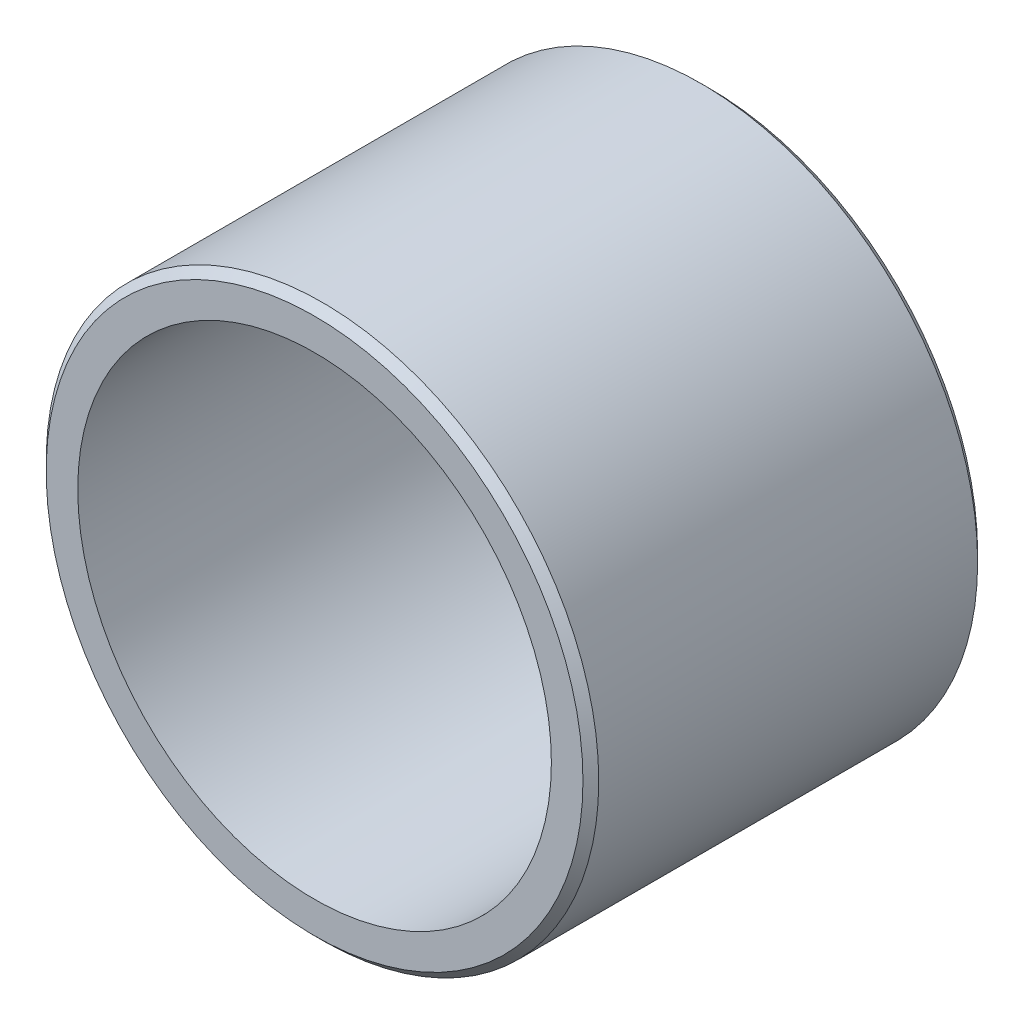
ISO-10303-21;
HEADER;
FILE_DESCRIPTION(('STEP AP214'),'2;1');
FILE_NAME('part.step','',(''),(''),'','','');
FILE_SCHEMA(('AUTOMOTIVE_DESIGN { 1 0 10303 214 1 1 1 1 }'));
ENDSEC;
DATA;
#1=APPLICATION_CONTEXT('core data for automotive mechanical design processes');
#2=APPLICATION_PROTOCOL_DEFINITION('international standard','automotive_design',2000,#1);
#3=PRODUCT_CONTEXT('',#1,'mechanical');
#4=PRODUCT('Part','Part','',(#3));
#5=PRODUCT_RELATED_PRODUCT_CATEGORY('part','',(#4));
#6=PRODUCT_DEFINITION_FORMATION('','',#4);
#7=PRODUCT_DEFINITION_CONTEXT('part definition',#1,'design');
#8=PRODUCT_DEFINITION('design','',#6,#7);
#9=PRODUCT_DEFINITION_SHAPE('','',#8);
#10=(LENGTH_UNIT() NAMED_UNIT(*) SI_UNIT(.MILLI.,.METRE.));
#11=(NAMED_UNIT(*) PLANE_ANGLE_UNIT() SI_UNIT($,.RADIAN.));
#12=(NAMED_UNIT(*) SI_UNIT($,.STERADIAN.) SOLID_ANGLE_UNIT());
#13=UNCERTAINTY_MEASURE_WITH_UNIT(LENGTH_MEASURE(1.E-05),#10,'distance_accuracy_value','');
#14=(GEOMETRIC_REPRESENTATION_CONTEXT(3) GLOBAL_UNCERTAINTY_ASSIGNED_CONTEXT((#13)) GLOBAL_UNIT_ASSIGNED_CONTEXT((#10,
#11,#12)) REPRESENTATION_CONTEXT('',''));
#15=CARTESIAN_POINT('',(0.,0.,0.));
#16=DIRECTION('',(0.,0.,1.));
#17=DIRECTION('',(1.,0.,0.));
#18=AXIS2_PLACEMENT_3D('',#15,#16,#17);
#19=CARTESIAN_POINT('',(0.,0.,10.));
#20=DIRECTION('',(0.,0.,-1.));
#21=DIRECTION('',(-1.,0.,0.));
#22=AXIS2_PLACEMENT_3D('',#19,#20,#21);
#23=CYLINDRICAL_SURFACE('',#22,7.);
#24=CARTESIAN_POINT('',(0.,0.,9.8));
#25=DIRECTION('',(0.,0.,1.));
#26=DIRECTION('',(1.,0.,0.));
#27=AXIS2_PLACEMENT_3D('',#24,#25,#26);
#28=CIRCLE('',#27,7.);
#29=CARTESIAN_POINT('',(7.,0.,9.8));
#30=VERTEX_POINT('',#29);
#31=EDGE_CURVE('E10',#30,#30,#28,.F.);
#32=ORIENTED_EDGE('',*,*,#31,.T.);
#33=EDGE_LOOP('',(#32));
#34=FACE_BOUND('',#33,.T.);
#35=CARTESIAN_POINT('',(0.,0.,0.200000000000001));
#36=DIRECTION('',(0.,0.,1.));
#37=DIRECTION('',(1.,0.,0.));
#38=AXIS2_PLACEMENT_3D('',#35,#36,#37);
#39=CIRCLE('',#38,7.);
#40=CARTESIAN_POINT('',(7.,0.,0.200000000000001));
#41=VERTEX_POINT('',#40);
#42=EDGE_CURVE('E45',#41,#41,#39,.T.);
#43=ORIENTED_EDGE('',*,*,#42,.T.);
#44=EDGE_LOOP('',(#43));
#45=FACE_BOUND('',#44,.T.);
#46=ADVANCED_FACE('F31',(#34,#45),#23,.T.);
#47=CARTESIAN_POINT('',(0.,0.,10.));
#48=DIRECTION('',(0.,0.,1.));
#49=DIRECTION('',(1.,0.,0.));
#50=AXIS2_PLACEMENT_3D('',#47,#48,#49);
#51=PLANE('',#50);
#52=CARTESIAN_POINT('',(0.,0.,10.));
#53=DIRECTION('',(0.,0.,1.));
#54=DIRECTION('',(1.,0.,0.));
#55=AXIS2_PLACEMENT_3D('',#52,#53,#54);
#56=CIRCLE('',#55,6.8);
#57=CARTESIAN_POINT('',(6.8,0.,10.));
#58=VERTEX_POINT('',#57);
#59=EDGE_CURVE('E37',#58,#58,#56,.T.);
#60=ORIENTED_EDGE('',*,*,#59,.T.);
#61=EDGE_LOOP('',(#60));
#62=FACE_BOUND('',#61,.T.);
#63=CARTESIAN_POINT('',(0.,0.,10.));
#64=DIRECTION('',(0.,0.,-1.));
#65=DIRECTION('',(-1.,0.,0.));
#66=AXIS2_PLACEMENT_3D('',#63,#64,#65);
#67=CIRCLE('',#66,6.);
#68=CARTESIAN_POINT('',(-6.,0.,10.));
#69=VERTEX_POINT('',#68);
#70=EDGE_CURVE('E50',#69,#69,#67,.T.);
#71=ORIENTED_EDGE('',*,*,#70,.T.);
#72=EDGE_LOOP('',(#71));
#73=FACE_BOUND('',#72,.T.);
#74=ADVANCED_FACE('F61',(#62,#73),#51,.T.);
#75=CARTESIAN_POINT('',(0.,0.,0.));
#76=DIRECTION('',(0.,0.,1.));
#77=DIRECTION('',(1.,0.,0.));
#78=AXIS2_PLACEMENT_3D('',#75,#76,#77);
#79=PLANE('',#78);
#80=CARTESIAN_POINT('',(0.,0.,0.));
#81=DIRECTION('',(0.,0.,1.));
#82=DIRECTION('',(1.,0.,0.));
#83=AXIS2_PLACEMENT_3D('',#80,#81,#82);
#84=CIRCLE('',#83,6.8);
#85=CARTESIAN_POINT('',(6.8,0.,0.));
#86=VERTEX_POINT('',#85);
#87=EDGE_CURVE('E41',#86,#86,#84,.F.);
#88=ORIENTED_EDGE('',*,*,#87,.T.);
#89=EDGE_LOOP('',(#88));
#90=FACE_BOUND('',#89,.T.);
#91=CARTESIAN_POINT('',(0.,0.,0.));
#92=DIRECTION('',(0.,0.,-1.));
#93=DIRECTION('',(-1.,0.,0.));
#94=AXIS2_PLACEMENT_3D('',#91,#92,#93);
#95=CIRCLE('',#94,6.);
#96=CARTESIAN_POINT('',(-6.,0.,0.));
#97=VERTEX_POINT('',#96);
#98=EDGE_CURVE('E53',#97,#97,#95,.T.);
#99=ORIENTED_EDGE('',*,*,#98,.F.);
#100=EDGE_LOOP('',(#99));
#101=FACE_BOUND('',#100,.T.);
#102=ADVANCED_FACE('F59',(#90,#101),#79,.F.);
#103=CARTESIAN_POINT('',(0.,0.,10.));
#104=DIRECTION('',(0.,0.,-1.));
#105=DIRECTION('',(-1.,0.,0.));
#106=AXIS2_PLACEMENT_3D('',#103,#104,#105);
#107=CYLINDRICAL_SURFACE('',#106,6.);
#108=ORIENTED_EDGE('',*,*,#70,.F.);
#109=EDGE_LOOP('',(#108));
#110=FACE_BOUND('',#109,.T.);
#111=ORIENTED_EDGE('',*,*,#98,.T.);
#112=EDGE_LOOP('',(#111));
#113=FACE_BOUND('',#112,.T.);
#114=ADVANCED_FACE('F57',(#110,#113),#107,.F.);
#115=CARTESIAN_POINT('',(0.,0.,0.200000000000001));
#116=DIRECTION('',(0.,0.,1.));
#117=DIRECTION('',(1.,0.,0.));
#118=AXIS2_PLACEMENT_3D('',#115,#116,#117);
#119=CONICAL_SURFACE('',#118,7.,0.785398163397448);
#120=ORIENTED_EDGE('',*,*,#87,.F.);
#121=EDGE_LOOP('',(#120));
#122=FACE_BOUND('',#121,.T.);
#123=ORIENTED_EDGE('',*,*,#42,.F.);
#124=EDGE_LOOP('',(#123));
#125=FACE_BOUND('',#124,.T.);
#126=ADVANCED_FACE('F68',(#122,#125),#119,.T.);
#127=CARTESIAN_POINT('',(0.,0.,10.));
#128=DIRECTION('',(0.,0.,-1.));
#129=DIRECTION('',(-1.,0.,0.));
#130=AXIS2_PLACEMENT_3D('',#127,#128,#129);
#131=CONICAL_SURFACE('',#130,6.8,0.78539816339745);
#132=ORIENTED_EDGE('',*,*,#31,.F.);
#133=EDGE_LOOP('',(#132));
#134=FACE_BOUND('',#133,.T.);
#135=ORIENTED_EDGE('',*,*,#59,.F.);
#136=EDGE_LOOP('',(#135));
#137=FACE_BOUND('',#136,.T.);
#138=ADVANCED_FACE('F78',(#134,#137),#131,.T.);
#139=CLOSED_SHELL('',(#46,#74,#102,#114,#126,#138));
#140=MANIFOLD_SOLID_BREP('B2',#139);
#141=ADVANCED_BREP_SHAPE_REPRESENTATION('',(#18,#140),#14);
#142=SHAPE_DEFINITION_REPRESENTATION(#9,#141);
ENDSEC;
END-ISO-10303-21;
